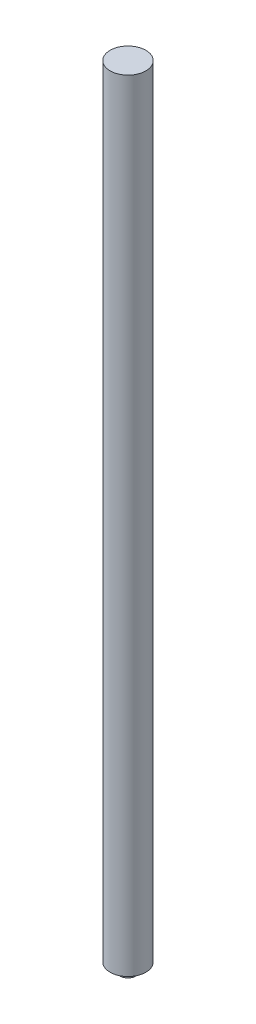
from build123d import *


with BuildPart() as part:
    # Sketch1 → Revolve1 (revolve)
    with BuildSketch(Plane.XY, mode=Mode.PRIVATE) as revolve1_sk:
        Polygon((0, 0), (5, 0), (5, 5), (11, 5), (11, 486), (0, 486), align=None)
    revolve(revolve1_sk.sketch.rotate(Axis((0, 486, 0), (0, -1, 0)), 180), axis=Axis((0, 486, 0), (0, -1, 0)))


solid = part.part
